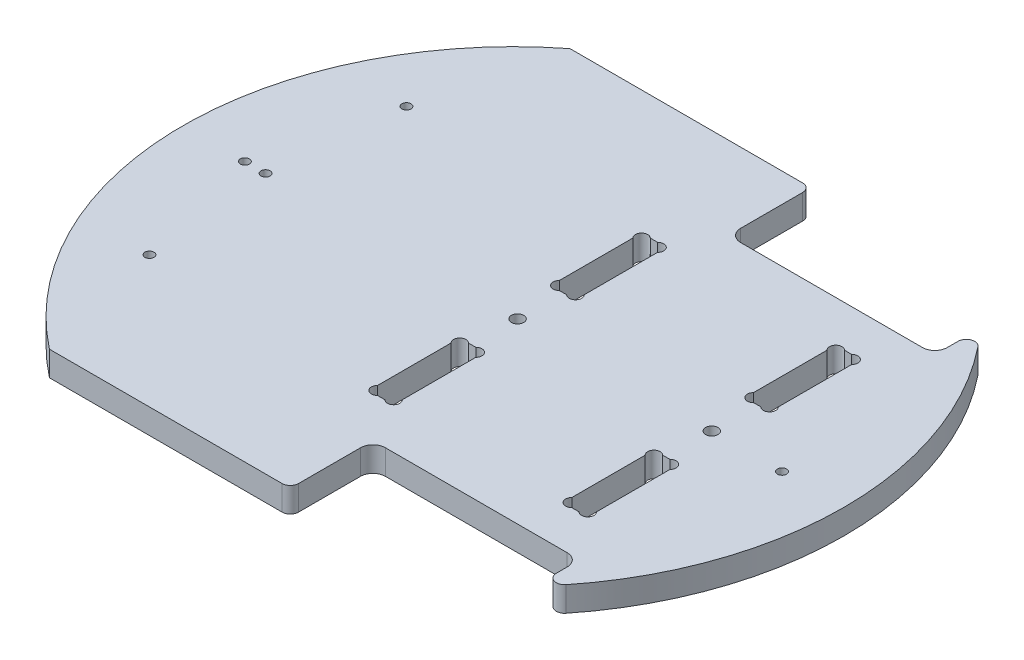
from build123d import *

# Parameters (mm, degrees)
ESQUISSE1_R      = 1.1
ESQUISSE1_R_2    = 1.5
EXTRUSION1_DEPTH = 6


with BuildPart() as part:
    # Esquisse1 → Extrusion1 (new body)
    with BuildSketch(Plane(origin=(0, 0, 0), x_dir=(1, 0, 0), z_dir=(0, 1, 0))):
        with BuildLine():
            Line((-64.305172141, -63.000000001), (-8, -63.000000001))
            ThreePointArc((-8, -63.000000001), (-6.585786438, -62.414213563), (-6, -61.000000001))
            Line((-6, -61.000000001), (-6, -46.000000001))
            ThreePointArc((-6, -46.000000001), (-5.121320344, -43.878679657), (-3, -43.000000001))
            Line((-3, -43.000000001), (41, -43.000000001))
            ThreePointArc((41, -43.000000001), (43.121320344, -43.878679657), (44, -46.000000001))
            Line((44, -46.000000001), (44, -48.610698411))
            ThreePointArc((44, -48.610698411), (45.339774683, -50.498581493), (47.56410253, -49.857126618))
            ThreePointArc((47.56410253, -49.857126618), (65.00001482, 4.0253e-05), (47.56410253, 49.857207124))
            ThreePointArc((47.56410253, 49.857207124), (45.339774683, 50.498661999), (44, 48.610778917))
            Line((44, 48.610778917), (44, 46.000001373))
            ThreePointArc((44, 46.000001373), (43.121320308, 43.878680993), (40.999999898, 43.000001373))
            Line((40.999999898, 43.000001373), (-3.000000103, 43.000002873))
            ThreePointArc((-3.000000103, 43.000002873), (-5.12132038, 43.878682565), (-6.000000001, 46.000002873))
            Line((-6.000000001, 46.000002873), (-6.000000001, 61.000049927))
            ThreePointArc((-6.000000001, 61.000049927), (-6.585786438, 62.414263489), (-8.000000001, 63.000049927))
            Line((-8.000000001, 63.000049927), (-64.305211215, 63.000049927))
            ThreePointArc((-64.305211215, 63.000049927), (-95.000049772, 1.5444e-05), (-64.305172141, -63.000000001))
        make_face()
        with Locations(Location((-80, 0, 0), (0, 0, 270))):
            Circle(ESQUISSE1_R, mode=Mode.SUBTRACT)
        with Locations(Location((50, 0, 0), (0, 0, 270))):
            Circle(ESQUISSE1_R, mode=Mode.SUBTRACT)
        with Locations(Location((33, 0, 0), (0, 0, 270))):
            Circle(ESQUISSE1_R_2, mode=Mode.SUBTRACT)
        with Locations(Location((-75, 0, 0), (0, 0, 270))):
            Circle(ESQUISSE1_R, mode=Mode.SUBTRACT)
        with Locations(Location((-14, 0, 0), (0, 0, 90))):
            Circle(ESQUISSE1_R_2, mode=Mode.SUBTRACT)
        with Locations(Location((-72, -31.1, 0), (0, 0, 270))):
            Circle(ESQUISSE1_R, mode=Mode.SUBTRACT)
        with Locations(Location((-72, 31.1, 0), (0, 0, 90))):
            Circle(ESQUISSE1_R, mode=Mode.SUBTRACT)
        with BuildLine():
            Line((32.121320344, 33), (33.878679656, 33))
            ThreePointArc((33.878679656, 33), (36, 33), (36, 30.878679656))
            Line((36, 30.878679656), (36, 13.121320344))
            ThreePointArc((36, 13.121320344), (36, 11), (33.878679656, 11))
            Line((33.878679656, 11), (32.121320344, 11))
            ThreePointArc((32.121320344, 11), (30, 11), (30, 13.121320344))
            Line((30, 13.121320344), (30, 30.878679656))
            ThreePointArc((30, 30.878679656), (30, 33), (32.121320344, 33))
        make_face(mode=Mode.SUBTRACT)
        with BuildLine():
            Line((33.878679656, -11), (32.121320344, -11))
            ThreePointArc((32.121320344, -11), (30, -11), (30, -13.121320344))
            Line((30, -13.121320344), (30, -30.878679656))
            ThreePointArc((30, -30.878679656), (30, -33), (32.121320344, -33))
            Line((32.121320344, -33), (33.878679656, -33))
            ThreePointArc((33.878679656, -33), (36, -33), (36, -30.878679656))
            Line((36, -30.878679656), (36, -13.121320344))
            ThreePointArc((36, -13.121320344), (36, -11), (33.878679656, -11))
        make_face(mode=Mode.SUBTRACT)
        with BuildLine():
            Line((-13.121320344, -33), (-14.878679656, -33))
            ThreePointArc((-14.878679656, -33), (-17, -33), (-17, -30.878679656))
            Line((-17, -30.878679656), (-17, -13.121320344))
            ThreePointArc((-17, -13.121320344), (-17, -11), (-14.878679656, -11))
            Line((-14.878679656, -11), (-13.121320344, -11))
            ThreePointArc((-13.121320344, -11), (-11, -11), (-11, -13.121320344))
            Line((-11, -13.121320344), (-11, -30.878679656))
            ThreePointArc((-11, -30.878679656), (-11, -33), (-13.121320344, -33))
        make_face(mode=Mode.SUBTRACT)
        with BuildLine():
            Line((-11, 13.121320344), (-11, 30.878679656))
            ThreePointArc((-11, 30.878679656), (-11, 33), (-13.121320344, 33))
            Line((-13.121320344, 33), (-14.878679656, 33))
            ThreePointArc((-14.878679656, 33), (-17, 33), (-17, 30.878679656))
            Line((-17, 30.878679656), (-17, 13.121320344))
            ThreePointArc((-17, 13.121320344), (-17, 11), (-14.878679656, 11))
            Line((-14.878679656, 11), (-13.121320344, 11))
            ThreePointArc((-13.121320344, 11), (-11, 11), (-11, 13.121320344))
        make_face(mode=Mode.SUBTRACT)
    extrude(amount=EXTRUSION1_DEPTH)


solid = part.part
